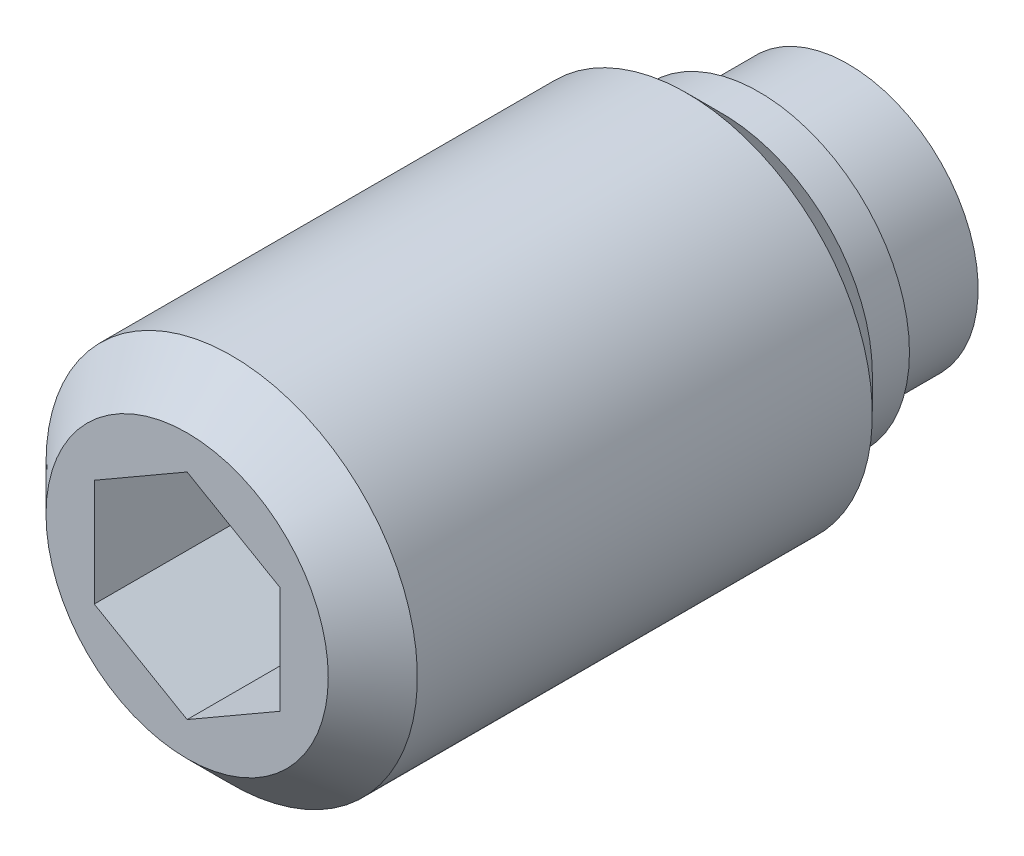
ISO-10303-21;
HEADER;
FILE_DESCRIPTION(('STEP AP214'),'2;1');
FILE_NAME('part.step','',(''),(''),'','','');
FILE_SCHEMA(('AUTOMOTIVE_DESIGN { 1 0 10303 214 1 1 1 1 }'));
ENDSEC;
DATA;
#1=APPLICATION_CONTEXT('core data for automotive mechanical design processes');
#2=APPLICATION_PROTOCOL_DEFINITION('international standard','automotive_design',2000,#1);
#3=PRODUCT_CONTEXT('',#1,'mechanical');
#4=PRODUCT('Part','Part','',(#3));
#5=PRODUCT_RELATED_PRODUCT_CATEGORY('part','',(#4));
#6=PRODUCT_DEFINITION_FORMATION('','',#4);
#7=PRODUCT_DEFINITION_CONTEXT('part definition',#1,'design');
#8=PRODUCT_DEFINITION('design','',#6,#7);
#9=PRODUCT_DEFINITION_SHAPE('','',#8);
#10=(LENGTH_UNIT() NAMED_UNIT(*) SI_UNIT(.MILLI.,.METRE.));
#11=(NAMED_UNIT(*) PLANE_ANGLE_UNIT() SI_UNIT($,.RADIAN.));
#12=(NAMED_UNIT(*) SI_UNIT($,.STERADIAN.) SOLID_ANGLE_UNIT());
#13=UNCERTAINTY_MEASURE_WITH_UNIT(LENGTH_MEASURE(1.E-05),#10,'distance_accuracy_value','');
#14=(GEOMETRIC_REPRESENTATION_CONTEXT(3) GLOBAL_UNCERTAINTY_ASSIGNED_CONTEXT((#13)) GLOBAL_UNIT_ASSIGNED_CONTEXT((#10,
#11,#12)) REPRESENTATION_CONTEXT('',''));
#15=CARTESIAN_POINT('',(0.,0.,0.));
#16=DIRECTION('',(0.,0.,1.));
#17=DIRECTION('',(1.,0.,0.));
#18=AXIS2_PLACEMENT_3D('',#15,#16,#17);
#19=CARTESIAN_POINT('',(0.,4.05,3.5));
#20=DIRECTION('',(0.,0.,1.));
#21=DIRECTION('',(1.,0.,0.));
#22=AXIS2_PLACEMENT_3D('',#19,#20,#21);
#23=PLANE('',#22);
#24=CARTESIAN_POINT('',(0.,0.,3.5));
#25=DIRECTION('',(0.,0.,-1.));
#26=DIRECTION('',(-1.,0.,0.));
#27=AXIS2_PLACEMENT_3D('',#24,#25,#26);
#28=CIRCLE('',#27,3.5);
#29=CARTESIAN_POINT('',(-3.50000000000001,0.,3.5));
#30=VERTEX_POINT('',#29);
#31=EDGE_CURVE('E103',#30,#30,#28,.T.);
#32=ORIENTED_EDGE('',*,*,#31,.F.);
#33=EDGE_LOOP('',(#32));
#34=FACE_BOUND('',#33,.T.);
#35=CARTESIAN_POINT('',(0.,0.,3.5));
#36=DIRECTION('',(0.,0.,-1.));
#37=DIRECTION('',(-1.,0.,0.));
#38=AXIS2_PLACEMENT_3D('',#35,#36,#37);
#39=CIRCLE('',#38,4.05);
#40=CARTESIAN_POINT('',(-4.05000000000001,0.,3.5));
#41=VERTEX_POINT('',#40);
#42=EDGE_CURVE('E123',#41,#41,#39,.T.);
#43=ORIENTED_EDGE('',*,*,#42,.T.);
#44=EDGE_LOOP('',(#43));
#45=FACE_BOUND('',#44,.T.);
#46=ADVANCED_FACE('F14',(#34,#45),#23,.F.);
#47=CARTESIAN_POINT('',(0.,0.,18.9));
#48=DIRECTION('',(0.,0.,-1.));
#49=DIRECTION('',(-1.,0.,0.));
#50=AXIS2_PLACEMENT_3D('',#47,#48,#49);
#51=PLANE('',#50);
#52=CARTESIAN_POINT('',(0.,0.,18.9));
#53=DIRECTION('',(0.,0.,-1.));
#54=DIRECTION('',(-1.,0.,0.));
#55=AXIS2_PLACEMENT_3D('',#52,#53,#54);
#56=CIRCLE('',#55,3.8);
#57=CARTESIAN_POINT('',(-3.80000000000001,0.,18.9));
#58=VERTEX_POINT('',#57);
#59=EDGE_CURVE('E9',#58,#58,#56,.T.);
#60=ORIENTED_EDGE('',*,*,#59,.F.);
#61=EDGE_LOOP('',(#60));
#62=FACE_BOUND('',#61,.T.);
#63=DIRECTION('',(0.866025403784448,-0.499999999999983,0.));
#64=VECTOR('',#63,1.);
#65=CARTESIAN_POINT('',(0.,2.8867513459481,18.9));
#66=LINE('',#65,#64);
#67=CARTESIAN_POINT('',(0.,2.8867513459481,18.9));
#68=VERTEX_POINT('',#67);
#69=CARTESIAN_POINT('',(2.5,1.4433756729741,18.9));
#70=VERTEX_POINT('',#69);
#71=EDGE_CURVE('E29',#68,#70,#66,.T.);
#72=ORIENTED_EDGE('',*,*,#71,.T.);
#73=DIRECTION('',(0.,-1.,0.));
#74=VECTOR('',#73,1.);
#75=CARTESIAN_POINT('',(2.5,1.4433756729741,18.9));
#76=LINE('',#75,#74);
#77=CARTESIAN_POINT('',(2.5,-1.4433756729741,18.9));
#78=VERTEX_POINT('',#77);
#79=EDGE_CURVE('E102',#70,#78,#76,.T.);
#80=ORIENTED_EDGE('',*,*,#79,.T.);
#81=DIRECTION('',(-0.866025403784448,-0.499999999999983,0.));
#82=VECTOR('',#81,1.);
#83=CARTESIAN_POINT('',(2.5,-1.4433756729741,18.9));
#84=LINE('',#83,#82);
#85=CARTESIAN_POINT('',(0.,-2.8867513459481,18.9));
#86=VERTEX_POINT('',#85);
#87=EDGE_CURVE('E106',#78,#86,#84,.T.);
#88=ORIENTED_EDGE('',*,*,#87,.T.);
#89=DIRECTION('',(-0.866025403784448,0.499999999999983,0.));
#90=VECTOR('',#89,1.);
#91=CARTESIAN_POINT('',(0.,-2.8867513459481,18.9));
#92=LINE('',#91,#90);
#93=CARTESIAN_POINT('',(-2.5,-1.4433756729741,18.9));
#94=VERTEX_POINT('',#93);
#95=EDGE_CURVE('E109',#86,#94,#92,.T.);
#96=ORIENTED_EDGE('',*,*,#95,.T.);
#97=DIRECTION('',(0.,1.,0.));
#98=VECTOR('',#97,1.);
#99=CARTESIAN_POINT('',(-2.5,-1.4433756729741,18.9));
#100=LINE('',#99,#98);
#101=CARTESIAN_POINT('',(-2.5,1.4433756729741,18.9));
#102=VERTEX_POINT('',#101);
#103=EDGE_CURVE('E92',#94,#102,#100,.T.);
#104=ORIENTED_EDGE('',*,*,#103,.T.);
#105=DIRECTION('',(0.866025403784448,0.499999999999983,0.));
#106=VECTOR('',#105,1.);
#107=CARTESIAN_POINT('',(-2.5,1.4433756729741,18.9));
#108=LINE('',#107,#106);
#109=EDGE_CURVE('E112',#102,#68,#108,.T.);
#110=ORIENTED_EDGE('',*,*,#109,.T.);
#111=EDGE_LOOP('',(#72,#80,#88,#96,#104,#110));
#112=FACE_BOUND('',#111,.T.);
#113=ADVANCED_FACE('F16',(#62,#112),#51,.F.);
#114=CARTESIAN_POINT('',(0.,0.,18.9));
#115=DIRECTION('',(0.,0.,-1.));
#116=DIRECTION('',(-1.,0.,0.));
#117=AXIS2_PLACEMENT_3D('',#114,#115,#116);
#118=CONICAL_SURFACE('',#117,3.8,0.785398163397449);
#119=CARTESIAN_POINT('',(0.,0.,17.7));
#120=DIRECTION('',(0.,0.,-1.));
#121=DIRECTION('',(-1.,0.,0.));
#122=AXIS2_PLACEMENT_3D('',#119,#120,#121);
#123=CIRCLE('',#122,5.);
#124=CARTESIAN_POINT('',(-5.00000000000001,0.,17.7));
#125=VERTEX_POINT('',#124);
#126=EDGE_CURVE('E22',#125,#125,#123,.T.);
#127=ORIENTED_EDGE('',*,*,#126,.F.);
#128=EDGE_LOOP('',(#127));
#129=FACE_BOUND('',#128,.T.);
#130=ORIENTED_EDGE('',*,*,#59,.T.);
#131=EDGE_LOOP('',(#130));
#132=FACE_BOUND('',#131,.T.);
#133=ADVANCED_FACE('F136',(#129,#132),#118,.T.);
#134=CARTESIAN_POINT('',(0.,0.,3.5));
#135=DIRECTION('',(0.,0.,-1.));
#136=DIRECTION('',(-1.,0.,0.));
#137=AXIS2_PLACEMENT_3D('',#134,#135,#136);
#138=CYLINDRICAL_SURFACE('',#137,5.);
#139=CARTESIAN_POINT('',(0.,0.,5.45));
#140=DIRECTION('',(0.,0.,-1.));
#141=DIRECTION('',(-1.,0.,0.));
#142=AXIS2_PLACEMENT_3D('',#139,#140,#141);
#143=CIRCLE('',#142,5.);
#144=CARTESIAN_POINT('',(-5.00000000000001,0.,5.45));
#145=VERTEX_POINT('',#144);
#146=EDGE_CURVE('E129',#145,#145,#143,.T.);
#147=ORIENTED_EDGE('',*,*,#146,.F.);
#148=EDGE_LOOP('',(#147));
#149=FACE_BOUND('',#148,.T.);
#150=ORIENTED_EDGE('',*,*,#126,.T.);
#151=EDGE_LOOP('',(#150));
#152=FACE_BOUND('',#151,.T.);
#153=ADVANCED_FACE('F134',(#149,#152),#138,.T.);
#154=CARTESIAN_POINT('',(0.,0.,5.45));
#155=DIRECTION('',(0.,0.,1.));
#156=DIRECTION('',(1.,0.,0.));
#157=AXIS2_PLACEMENT_3D('',#154,#155,#156);
#158=CONICAL_SURFACE('',#157,5.,0.785398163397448);
#159=CARTESIAN_POINT('',(0.,0.,4.5));
#160=DIRECTION('',(0.,0.,-1.));
#161=DIRECTION('',(-1.,0.,0.));
#162=AXIS2_PLACEMENT_3D('',#159,#160,#161);
#163=CIRCLE('',#162,4.05);
#164=CARTESIAN_POINT('',(-4.05000000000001,0.,4.5));
#165=VERTEX_POINT('',#164);
#166=EDGE_CURVE('E126',#165,#165,#163,.T.);
#167=ORIENTED_EDGE('',*,*,#166,.F.);
#168=EDGE_LOOP('',(#167));
#169=FACE_BOUND('',#168,.T.);
#170=ORIENTED_EDGE('',*,*,#146,.T.);
#171=EDGE_LOOP('',(#170));
#172=FACE_BOUND('',#171,.T.);
#173=ADVANCED_FACE('F178',(#169,#172),#158,.T.);
#174=CARTESIAN_POINT('',(0.,0.,3.5));
#175=DIRECTION('',(0.,0.,-1.));
#176=DIRECTION('',(-1.,0.,0.));
#177=AXIS2_PLACEMENT_3D('',#174,#175,#176);
#178=CYLINDRICAL_SURFACE('',#177,4.05);
#179=ORIENTED_EDGE('',*,*,#42,.F.);
#180=EDGE_LOOP('',(#179));
#181=FACE_BOUND('',#180,.T.);
#182=ORIENTED_EDGE('',*,*,#166,.T.);
#183=EDGE_LOOP('',(#182));
#184=FACE_BOUND('',#183,.T.);
#185=ADVANCED_FACE('F165',(#181,#184),#178,.T.);
#186=CARTESIAN_POINT('',(0.,2.8867513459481,12.9));
#187=DIRECTION('',(-0.499999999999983,-0.866025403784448,0.));
#188=DIRECTION('',(-0.866025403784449,0.499999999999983,0.));
#189=AXIS2_PLACEMENT_3D('',#186,#187,#188);
#190=PLANE('',#189);
#191=ORIENTED_EDGE('',*,*,#71,.F.);
#192=DIRECTION('',(0.,0.,1.));
#193=VECTOR('',#192,1.);
#194=CARTESIAN_POINT('',(0.,2.8867513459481,12.9));
#195=LINE('',#194,#193);
#196=CARTESIAN_POINT('',(0.,2.8867513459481,12.9));
#197=VERTEX_POINT('',#196);
#198=EDGE_CURVE('E97',#197,#68,#195,.T.);
#199=ORIENTED_EDGE('',*,*,#198,.F.);
#200=DIRECTION('',(0.866025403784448,-0.499999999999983,0.));
#201=VECTOR('',#200,1.);
#202=CARTESIAN_POINT('',(0.,2.8867513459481,12.9));
#203=LINE('',#202,#201);
#204=CARTESIAN_POINT('',(2.5,1.4433756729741,12.9));
#205=VERTEX_POINT('',#204);
#206=EDGE_CURVE('E115',#197,#205,#203,.T.);
#207=ORIENTED_EDGE('',*,*,#206,.T.);
#208=DIRECTION('',(0.,0.,1.));
#209=VECTOR('',#208,1.);
#210=CARTESIAN_POINT('',(2.5,1.4433756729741,12.9));
#211=LINE('',#210,#209);
#212=EDGE_CURVE('E121',#205,#70,#211,.T.);
#213=ORIENTED_EDGE('',*,*,#212,.T.);
#214=EDGE_LOOP('',(#191,#199,#207,#213));
#215=FACE_BOUND('',#214,.T.);
#216=ADVANCED_FACE('F144',(#215),#190,.T.);
#217=CARTESIAN_POINT('',(2.5,1.4433756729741,12.9));
#218=DIRECTION('',(-1.,0.,0.));
#219=DIRECTION('',(0.,0.,1.));
#220=AXIS2_PLACEMENT_3D('',#217,#218,#219);
#221=PLANE('',#220);
#222=ORIENTED_EDGE('',*,*,#79,.F.);
#223=ORIENTED_EDGE('',*,*,#212,.F.);
#224=DIRECTION('',(0.,-1.,0.));
#225=VECTOR('',#224,1.);
#226=CARTESIAN_POINT('',(2.5,1.4433756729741,12.9));
#227=LINE('',#226,#225);
#228=CARTESIAN_POINT('',(2.5,-1.4433756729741,12.9));
#229=VERTEX_POINT('',#228);
#230=EDGE_CURVE('E69',#205,#229,#227,.T.);
#231=ORIENTED_EDGE('',*,*,#230,.T.);
#232=DIRECTION('',(0.,0.,1.));
#233=VECTOR('',#232,1.);
#234=CARTESIAN_POINT('',(2.5,-1.4433756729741,12.9));
#235=LINE('',#234,#233);
#236=EDGE_CURVE('E119',#229,#78,#235,.T.);
#237=ORIENTED_EDGE('',*,*,#236,.T.);
#238=EDGE_LOOP('',(#222,#223,#231,#237));
#239=FACE_BOUND('',#238,.T.);
#240=ADVANCED_FACE('F155',(#239),#221,.T.);
#241=CARTESIAN_POINT('',(2.5,-1.4433756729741,12.9));
#242=DIRECTION('',(-0.499999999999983,0.866025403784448,0.));
#243=DIRECTION('',(0.866025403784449,0.499999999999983,0.));
#244=AXIS2_PLACEMENT_3D('',#241,#242,#243);
#245=PLANE('',#244);
#246=ORIENTED_EDGE('',*,*,#87,.F.);
#247=ORIENTED_EDGE('',*,*,#236,.F.);
#248=DIRECTION('',(-0.866025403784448,-0.499999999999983,0.));
#249=VECTOR('',#248,1.);
#250=CARTESIAN_POINT('',(2.5,-1.4433756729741,12.9));
#251=LINE('',#250,#249);
#252=CARTESIAN_POINT('',(0.,-2.8867513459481,12.9));
#253=VERTEX_POINT('',#252);
#254=EDGE_CURVE('E88',#229,#253,#251,.T.);
#255=ORIENTED_EDGE('',*,*,#254,.T.);
#256=DIRECTION('',(0.,0.,1.));
#257=VECTOR('',#256,1.);
#258=CARTESIAN_POINT('',(0.,-2.8867513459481,12.9));
#259=LINE('',#258,#257);
#260=EDGE_CURVE('E85',#253,#86,#259,.T.);
#261=ORIENTED_EDGE('',*,*,#260,.T.);
#262=EDGE_LOOP('',(#246,#247,#255,#261));
#263=FACE_BOUND('',#262,.T.);
#264=ADVANCED_FACE('F153',(#263),#245,.T.);
#265=CARTESIAN_POINT('',(0.,-2.8867513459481,12.9));
#266=DIRECTION('',(0.499999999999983,0.866025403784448,0.));
#267=DIRECTION('',(0.866025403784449,-0.499999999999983,0.));
#268=AXIS2_PLACEMENT_3D('',#265,#266,#267);
#269=PLANE('',#268);
#270=ORIENTED_EDGE('',*,*,#95,.F.);
#271=ORIENTED_EDGE('',*,*,#260,.F.);
#272=DIRECTION('',(-0.866025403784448,0.499999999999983,0.));
#273=VECTOR('',#272,1.);
#274=CARTESIAN_POINT('',(0.,-2.8867513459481,12.9));
#275=LINE('',#274,#273);
#276=CARTESIAN_POINT('',(-2.5,-1.4433756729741,12.9));
#277=VERTEX_POINT('',#276);
#278=EDGE_CURVE('E80',#253,#277,#275,.T.);
#279=ORIENTED_EDGE('',*,*,#278,.T.);
#280=DIRECTION('',(0.,0.,1.));
#281=VECTOR('',#280,1.);
#282=CARTESIAN_POINT('',(-2.5,-1.4433756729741,12.9));
#283=LINE('',#282,#281);
#284=EDGE_CURVE('E84',#277,#94,#283,.T.);
#285=ORIENTED_EDGE('',*,*,#284,.T.);
#286=EDGE_LOOP('',(#270,#271,#279,#285));
#287=FACE_BOUND('',#286,.T.);
#288=ADVANCED_FACE('F83',(#287),#269,.T.);
#289=CARTESIAN_POINT('',(-2.5,-1.4433756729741,12.9));
#290=DIRECTION('',(1.,0.,0.));
#291=DIRECTION('',(0.,0.,-1.));
#292=AXIS2_PLACEMENT_3D('',#289,#290,#291);
#293=PLANE('',#292);
#294=ORIENTED_EDGE('',*,*,#103,.F.);
#295=ORIENTED_EDGE('',*,*,#284,.F.);
#296=DIRECTION('',(0.,1.,0.));
#297=VECTOR('',#296,1.);
#298=CARTESIAN_POINT('',(-2.5,-1.4433756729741,12.9));
#299=LINE('',#298,#297);
#300=CARTESIAN_POINT('',(-2.5,1.4433756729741,12.9));
#301=VERTEX_POINT('',#300);
#302=EDGE_CURVE('E87',#277,#301,#299,.T.);
#303=ORIENTED_EDGE('',*,*,#302,.T.);
#304=DIRECTION('',(0.,0.,1.));
#305=VECTOR('',#304,1.);
#306=CARTESIAN_POINT('',(-2.5,1.4433756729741,12.9));
#307=LINE('',#306,#305);
#308=EDGE_CURVE('E60',#301,#102,#307,.T.);
#309=ORIENTED_EDGE('',*,*,#308,.T.);
#310=EDGE_LOOP('',(#294,#295,#303,#309));
#311=FACE_BOUND('',#310,.T.);
#312=ADVANCED_FACE('F90',(#311),#293,.T.);
#313=CARTESIAN_POINT('',(-2.5,1.4433756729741,12.9));
#314=DIRECTION('',(0.499999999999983,-0.866025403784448,0.));
#315=DIRECTION('',(-0.866025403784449,-0.499999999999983,0.));
#316=AXIS2_PLACEMENT_3D('',#313,#314,#315);
#317=PLANE('',#316);
#318=ORIENTED_EDGE('',*,*,#109,.F.);
#319=ORIENTED_EDGE('',*,*,#308,.F.);
#320=DIRECTION('',(0.866025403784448,0.499999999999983,0.));
#321=VECTOR('',#320,1.);
#322=CARTESIAN_POINT('',(-2.5,1.4433756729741,12.9));
#323=LINE('',#322,#321);
#324=EDGE_CURVE('E37',#301,#197,#323,.T.);
#325=ORIENTED_EDGE('',*,*,#324,.T.);
#326=ORIENTED_EDGE('',*,*,#198,.T.);
#327=EDGE_LOOP('',(#318,#319,#325,#326));
#328=FACE_BOUND('',#327,.T.);
#329=ADVANCED_FACE('F143',(#328),#317,.T.);
#330=CARTESIAN_POINT('',(0.,0.,12.9));
#331=DIRECTION('',(0.,0.,-1.));
#332=DIRECTION('',(-1.,0.,0.));
#333=AXIS2_PLACEMENT_3D('',#330,#331,#332);
#334=PLANE('',#333);
#335=ORIENTED_EDGE('',*,*,#206,.F.);
#336=ORIENTED_EDGE('',*,*,#324,.F.);
#337=ORIENTED_EDGE('',*,*,#302,.F.);
#338=ORIENTED_EDGE('',*,*,#278,.F.);
#339=ORIENTED_EDGE('',*,*,#254,.F.);
#340=ORIENTED_EDGE('',*,*,#230,.F.);
#341=EDGE_LOOP('',(#335,#336,#337,#338,#339,#340));
#342=FACE_BOUND('',#341,.T.);
#343=ADVANCED_FACE('F95',(#342),#334,.F.);
#344=CARTESIAN_POINT('',(0.,0.,0.));
#345=DIRECTION('',(0.,0.,-1.));
#346=DIRECTION('',(-1.,0.,0.));
#347=AXIS2_PLACEMENT_3D('',#344,#345,#346);
#348=CYLINDRICAL_SURFACE('',#347,3.5);
#349=CARTESIAN_POINT('',(0.,0.,1.1));
#350=DIRECTION('',(0.,0.,-1.));
#351=DIRECTION('',(-1.,0.,0.));
#352=AXIS2_PLACEMENT_3D('',#349,#350,#351);
#353=CIRCLE('',#352,3.5);
#354=CARTESIAN_POINT('',(-3.50000000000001,0.,1.1));
#355=VERTEX_POINT('',#354);
#356=EDGE_CURVE('E297',#355,#355,#353,.T.);
#357=ORIENTED_EDGE('',*,*,#356,.F.);
#358=EDGE_LOOP('',(#357));
#359=FACE_BOUND('',#358,.T.);
#360=ORIENTED_EDGE('',*,*,#31,.T.);
#361=EDGE_LOOP('',(#360));
#362=FACE_BOUND('',#361,.T.);
#363=ADVANCED_FACE('F263',(#359,#362),#348,.T.);
#364=CARTESIAN_POINT('',(-0.0371790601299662,0.,5.9998848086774));
#365=DIRECTION('',(0.,-1.,0.));
#366=DIRECTION('',(-1.,0.,0.));
#367=AXIS2_PLACEMENT_3D('',#364,#365,#366);
#368=CIRCLE('',#367,5.99999999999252);
#369=TRIMMED_CURVE('',#368,(PARAMETER_VALUE(-1.57699287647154)),
(PARAMETER_VALUE(1.57699287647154)),.T.,.PARAMETER.);
#370=CARTESIAN_POINT('',(0.,0.,5.9998848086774));
#371=DIRECTION('',(0.,0.,-1.));
#372=AXIS1_PLACEMENT('',#370,#371);
#373=SURFACE_OF_REVOLUTION('',#369,#372);
#374=ORIENTED_EDGE('',*,*,#356,.T.);
#375=EDGE_LOOP('',(#374));
#376=FACE_BOUND('',#375,.T.);
#377=CARTESIAN_POINT('',(0.,0.,0.));
#378=VERTEX_POINT('',#377);
#379=VERTEX_LOOP('',#378);
#380=FACE_BOUND('',#379,.T.);
#381=ADVANCED_FACE('F270',(#376,#380),#373,.T.);
#382=CLOSED_SHELL('',(#46,#113,#133,#153,#173,#185,#216,#240,#264,#288,#312,#329,#343,#363,#381));
#383=MANIFOLD_SOLID_BREP('B1',#382);
#384=ADVANCED_BREP_SHAPE_REPRESENTATION('',(#18,#383),#14);
#385=SHAPE_DEFINITION_REPRESENTATION(#9,#384);
ENDSEC;
END-ISO-10303-21;
